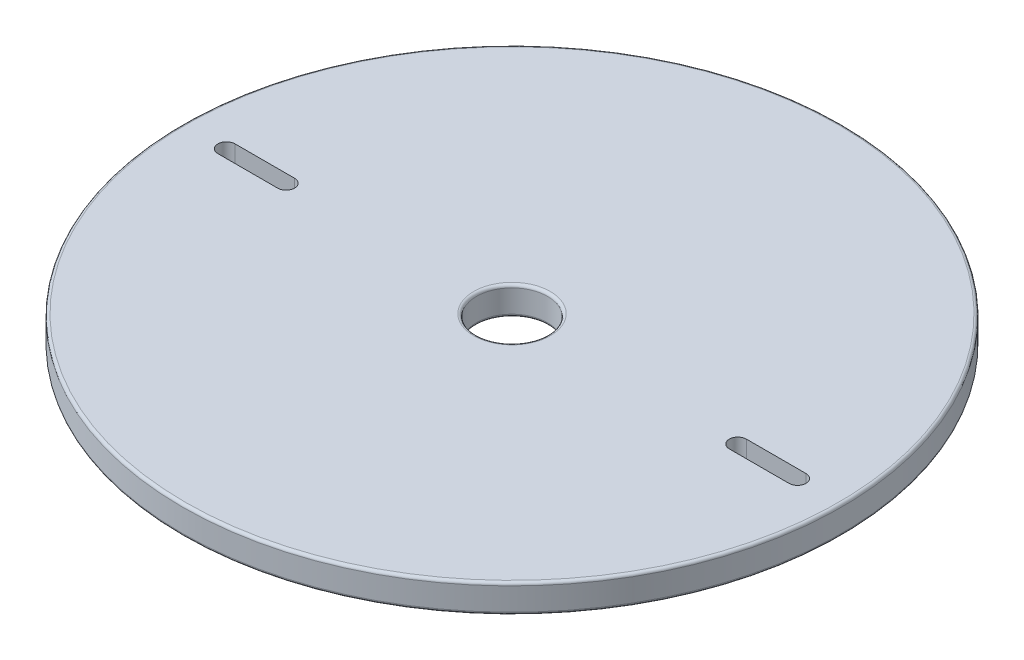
ISO-10303-21;
HEADER;
FILE_DESCRIPTION(('STEP AP214'),'2;1');
FILE_NAME('part.step','',(''),(''),'','','');
FILE_SCHEMA(('AUTOMOTIVE_DESIGN { 1 0 10303 214 1 1 1 1 }'));
ENDSEC;
DATA;
#1=APPLICATION_CONTEXT('core data for automotive mechanical design processes');
#2=APPLICATION_PROTOCOL_DEFINITION('international standard','automotive_design',2000,#1);
#3=PRODUCT_CONTEXT('',#1,'mechanical');
#4=PRODUCT('Part','Part','',(#3));
#5=PRODUCT_RELATED_PRODUCT_CATEGORY('part','',(#4));
#6=PRODUCT_DEFINITION_FORMATION('','',#4);
#7=PRODUCT_DEFINITION_CONTEXT('part definition',#1,'design');
#8=PRODUCT_DEFINITION('design','',#6,#7);
#9=PRODUCT_DEFINITION_SHAPE('','',#8);
#10=(LENGTH_UNIT() NAMED_UNIT(*) SI_UNIT(.MILLI.,.METRE.));
#11=(NAMED_UNIT(*) PLANE_ANGLE_UNIT() SI_UNIT($,.RADIAN.));
#12=(NAMED_UNIT(*) SI_UNIT($,.STERADIAN.) SOLID_ANGLE_UNIT());
#13=UNCERTAINTY_MEASURE_WITH_UNIT(LENGTH_MEASURE(1.E-05),#10,'distance_accuracy_value','');
#14=(GEOMETRIC_REPRESENTATION_CONTEXT(3) GLOBAL_UNCERTAINTY_ASSIGNED_CONTEXT((#13)) GLOBAL_UNIT_ASSIGNED_CONTEXT((#10,
#11,#12)) REPRESENTATION_CONTEXT('',''));
#15=CARTESIAN_POINT('',(0.,0.,0.));
#16=DIRECTION('',(0.,0.,1.));
#17=DIRECTION('',(1.,0.,0.));
#18=AXIS2_PLACEMENT_3D('',#15,#16,#17);
#19=CARTESIAN_POINT('',(0.,0.5,0.));
#20=DIRECTION('',(0.,1.,0.));
#21=DIRECTION('',(0.,0.,1.));
#22=AXIS2_PLACEMENT_3D('',#19,#20,#21);
#23=PLANE('',#22);
#24=CARTESIAN_POINT('',(0.,0.5,0.));
#25=DIRECTION('',(0.,1.,0.));
#26=DIRECTION('',(0.,0.,1.));
#27=AXIS2_PLACEMENT_3D('',#24,#25,#26);
#28=CIRCLE('',#27,11.5);
#29=CARTESIAN_POINT('',(0.,0.5,11.5));
#30=VERTEX_POINT('',#29);
#31=EDGE_CURVE('E177',#30,#30,#28,.T.);
#32=ORIENTED_EDGE('',*,*,#31,.T.);
#33=EDGE_LOOP('',(#32));
#34=FACE_BOUND('',#33,.T.);
#35=CARTESIAN_POINT('',(0.,0.5,0.));
#36=DIRECTION('',(0.,1.,0.));
#37=DIRECTION('',(0.,0.,1.));
#38=AXIS2_PLACEMENT_3D('',#35,#36,#37);
#39=CIRCLE('',#38,1.35);
#40=CARTESIAN_POINT('',(0.,0.5,1.35));
#41=VERTEX_POINT('',#40);
#42=EDGE_CURVE('E174',#41,#41,#39,.F.);
#43=ORIENTED_EDGE('',*,*,#42,.T.);
#44=EDGE_LOOP('',(#43));
#45=FACE_BOUND('',#44,.T.);
#46=CARTESIAN_POINT('',(-10.05,0.5,0.));
#47=DIRECTION('',(0.,1.,0.));
#48=DIRECTION('',(0.,0.,1.));
#49=AXIS2_PLACEMENT_3D('',#46,#47,#48);
#50=CIRCLE('',#49,0.3);
#51=CARTESIAN_POINT('',(-10.05,0.5,-0.3));
#52=VERTEX_POINT('',#51);
#53=CARTESIAN_POINT('',(-10.05,0.5,0.3));
#54=VERTEX_POINT('',#53);
#55=EDGE_CURVE('E139',#52,#54,#50,.T.);
#56=ORIENTED_EDGE('',*,*,#55,.F.);
#57=DIRECTION('',(-1.,0.,0.));
#58=VECTOR('',#57,1.);
#59=CARTESIAN_POINT('',(-10.05,0.5,-0.3));
#60=LINE('',#59,#58);
#61=CARTESIAN_POINT('',(-7.95,0.5,-0.3));
#62=VERTEX_POINT('',#61);
#63=EDGE_CURVE('E147',#62,#52,#60,.T.);
#64=ORIENTED_EDGE('',*,*,#63,.F.);
#65=CARTESIAN_POINT('',(-7.95,0.5,0.));
#66=DIRECTION('',(0.,1.,0.));
#67=DIRECTION('',(0.,0.,1.));
#68=AXIS2_PLACEMENT_3D('',#65,#66,#67);
#69=CIRCLE('',#68,0.3);
#70=CARTESIAN_POINT('',(-7.95,0.5,0.3));
#71=VERTEX_POINT('',#70);
#72=EDGE_CURVE('E144',#71,#62,#69,.T.);
#73=ORIENTED_EDGE('',*,*,#72,.F.);
#74=DIRECTION('',(1.,0.,0.));
#75=VECTOR('',#74,1.);
#76=CARTESIAN_POINT('',(-10.05,0.5,0.3));
#77=LINE('',#76,#75);
#78=EDGE_CURVE('E141',#54,#71,#77,.T.);
#79=ORIENTED_EDGE('',*,*,#78,.F.);
#80=EDGE_LOOP('',(#56,#64,#73,#79));
#81=FACE_BOUND('',#80,.T.);
#82=DIRECTION('',(1.,0.,0.));
#83=VECTOR('',#82,1.);
#84=CARTESIAN_POINT('',(10.05,0.5,-0.3));
#85=LINE('',#84,#83);
#86=CARTESIAN_POINT('',(7.95,0.5,-0.3));
#87=VERTEX_POINT('',#86);
#88=CARTESIAN_POINT('',(10.05,0.5,-0.3));
#89=VERTEX_POINT('',#88);
#90=EDGE_CURVE('E116',#87,#89,#85,.T.);
#91=ORIENTED_EDGE('',*,*,#90,.T.);
#92=CARTESIAN_POINT('',(10.05,0.5,0.));
#93=DIRECTION('',(0.,-1.,0.));
#94=DIRECTION('',(0.,0.,1.));
#95=AXIS2_PLACEMENT_3D('',#92,#93,#94);
#96=CIRCLE('',#95,0.3);
#97=CARTESIAN_POINT('',(10.05,0.5,0.3));
#98=VERTEX_POINT('',#97);
#99=EDGE_CURVE('E48',#89,#98,#96,.T.);
#100=ORIENTED_EDGE('',*,*,#99,.T.);
#101=DIRECTION('',(-1.,0.,0.));
#102=VECTOR('',#101,1.);
#103=CARTESIAN_POINT('',(10.05,0.5,0.3));
#104=LINE('',#103,#102);
#105=CARTESIAN_POINT('',(7.95,0.5,0.3));
#106=VERTEX_POINT('',#105);
#107=EDGE_CURVE('E110',#98,#106,#104,.T.);
#108=ORIENTED_EDGE('',*,*,#107,.T.);
#109=CARTESIAN_POINT('',(7.95,0.5,0.));
#110=DIRECTION('',(0.,-1.,0.));
#111=DIRECTION('',(0.,0.,1.));
#112=AXIS2_PLACEMENT_3D('',#109,#110,#111);
#113=CIRCLE('',#112,0.3);
#114=EDGE_CURVE('E123',#106,#87,#113,.T.);
#115=ORIENTED_EDGE('',*,*,#114,.T.);
#116=EDGE_LOOP('',(#91,#100,#108,#115));
#117=FACE_BOUND('',#116,.T.);
#118=ADVANCED_FACE('F33',(#34,#45,#81,#117),#23,.T.);
#119=CARTESIAN_POINT('',(0.,-0.5,0.));
#120=DIRECTION('',(0.,1.,0.));
#121=DIRECTION('',(0.,0.,1.));
#122=AXIS2_PLACEMENT_3D('',#119,#120,#121);
#123=PLANE('',#122);
#124=CARTESIAN_POINT('',(0.,-0.5,0.));
#125=DIRECTION('',(0.,1.,0.));
#126=DIRECTION('',(0.,0.,1.));
#127=AXIS2_PLACEMENT_3D('',#124,#125,#126);
#128=CIRCLE('',#127,11.5);
#129=CARTESIAN_POINT('',(0.,-0.5,11.5));
#130=VERTEX_POINT('',#129);
#131=EDGE_CURVE('E171',#130,#130,#128,.F.);
#132=ORIENTED_EDGE('',*,*,#131,.T.);
#133=EDGE_LOOP('',(#132));
#134=FACE_BOUND('',#133,.T.);
#135=CARTESIAN_POINT('',(0.,-0.5,0.));
#136=DIRECTION('',(0.,1.,0.));
#137=DIRECTION('',(0.,0.,1.));
#138=AXIS2_PLACEMENT_3D('',#135,#136,#137);
#139=CIRCLE('',#138,1.35);
#140=CARTESIAN_POINT('',(0.,-0.5,1.35));
#141=VERTEX_POINT('',#140);
#142=EDGE_CURVE('E168',#141,#141,#139,.T.);
#143=ORIENTED_EDGE('',*,*,#142,.T.);
#144=EDGE_LOOP('',(#143));
#145=FACE_BOUND('',#144,.T.);
#146=DIRECTION('',(1.,0.,0.));
#147=VECTOR('',#146,1.);
#148=CARTESIAN_POINT('',(-10.05,-0.5,-0.3));
#149=LINE('',#148,#147);
#150=CARTESIAN_POINT('',(-10.05,-0.5,-0.3));
#151=VERTEX_POINT('',#150);
#152=CARTESIAN_POINT('',(-7.95,-0.5,-0.3));
#153=VERTEX_POINT('',#152);
#154=EDGE_CURVE('E133',#151,#153,#149,.T.);
#155=ORIENTED_EDGE('',*,*,#154,.F.);
#156=CARTESIAN_POINT('',(-10.05,-0.5,0.));
#157=DIRECTION('',(0.,1.,0.));
#158=DIRECTION('',(0.,0.,1.));
#159=AXIS2_PLACEMENT_3D('',#156,#157,#158);
#160=CIRCLE('',#159,0.3);
#161=CARTESIAN_POINT('',(-10.05,-0.5,0.3));
#162=VERTEX_POINT('',#161);
#163=EDGE_CURVE('E136',#162,#151,#160,.F.);
#164=ORIENTED_EDGE('',*,*,#163,.F.);
#165=DIRECTION('',(-1.,0.,0.));
#166=VECTOR('',#165,1.);
#167=CARTESIAN_POINT('',(-10.05,-0.5,0.3));
#168=LINE('',#167,#166);
#169=CARTESIAN_POINT('',(-7.95,-0.5,0.3));
#170=VERTEX_POINT('',#169);
#171=EDGE_CURVE('E153',#170,#162,#168,.T.);
#172=ORIENTED_EDGE('',*,*,#171,.F.);
#173=CARTESIAN_POINT('',(-7.95,-0.5,0.));
#174=DIRECTION('',(0.,1.,0.));
#175=DIRECTION('',(0.,0.,1.));
#176=AXIS2_PLACEMENT_3D('',#173,#174,#175);
#177=CIRCLE('',#176,0.3);
#178=EDGE_CURVE('E104',#153,#170,#177,.F.);
#179=ORIENTED_EDGE('',*,*,#178,.F.);
#180=EDGE_LOOP('',(#155,#164,#172,#179));
#181=FACE_BOUND('',#180,.T.);
#182=CARTESIAN_POINT('',(10.05,-0.5,0.));
#183=DIRECTION('',(0.,1.,0.));
#184=DIRECTION('',(0.,0.,1.));
#185=AXIS2_PLACEMENT_3D('',#182,#183,#184);
#186=CIRCLE('',#185,0.3);
#187=CARTESIAN_POINT('',(10.05,-0.5,0.3));
#188=VERTEX_POINT('',#187);
#189=CARTESIAN_POINT('',(10.05,-0.5,-0.3));
#190=VERTEX_POINT('',#189);
#191=EDGE_CURVE('E108',#188,#190,#186,.T.);
#192=ORIENTED_EDGE('',*,*,#191,.T.);
#193=DIRECTION('',(-1.,0.,0.));
#194=VECTOR('',#193,1.);
#195=CARTESIAN_POINT('',(10.05,-0.5,-0.3));
#196=LINE('',#195,#194);
#197=CARTESIAN_POINT('',(7.95,-0.5,-0.3));
#198=VERTEX_POINT('',#197);
#199=EDGE_CURVE('E97',#190,#198,#196,.T.);
#200=ORIENTED_EDGE('',*,*,#199,.T.);
#201=CARTESIAN_POINT('',(7.95,-0.5,0.));
#202=DIRECTION('',(0.,1.,0.));
#203=DIRECTION('',(0.,0.,1.));
#204=AXIS2_PLACEMENT_3D('',#201,#202,#203);
#205=CIRCLE('',#204,0.3);
#206=CARTESIAN_POINT('',(7.95,-0.5,0.3));
#207=VERTEX_POINT('',#206);
#208=EDGE_CURVE('E118',#198,#207,#205,.T.);
#209=ORIENTED_EDGE('',*,*,#208,.T.);
#210=DIRECTION('',(1.,0.,0.));
#211=VECTOR('',#210,1.);
#212=CARTESIAN_POINT('',(10.05,-0.5,0.3));
#213=LINE('',#212,#211);
#214=EDGE_CURVE('E114',#207,#188,#213,.T.);
#215=ORIENTED_EDGE('',*,*,#214,.T.);
#216=EDGE_LOOP('',(#192,#200,#209,#215));
#217=FACE_BOUND('',#216,.T.);
#218=ADVANCED_FACE('F113',(#134,#145,#181,#217),#123,.F.);
#219=CARTESIAN_POINT('',(0.,0.5,0.));
#220=DIRECTION('',(0.,-1.,0.));
#221=DIRECTION('',(0.,0.,-1.));
#222=AXIS2_PLACEMENT_3D('',#219,#220,#221);
#223=CYLINDRICAL_SURFACE('',#222,11.6);
#224=CARTESIAN_POINT('',(0.,-0.4,0.));
#225=DIRECTION('',(0.,1.,0.));
#226=DIRECTION('',(0.,0.,1.));
#227=AXIS2_PLACEMENT_3D('',#224,#225,#226);
#228=CIRCLE('',#227,11.6);
#229=CARTESIAN_POINT('',(0.,-0.4,11.6));
#230=VERTEX_POINT('',#229);
#231=EDGE_CURVE('E165',#230,#230,#228,.T.);
#232=ORIENTED_EDGE('',*,*,#231,.T.);
#233=EDGE_LOOP('',(#232));
#234=FACE_BOUND('',#233,.T.);
#235=CARTESIAN_POINT('',(0.,0.4,0.));
#236=DIRECTION('',(0.,1.,0.));
#237=DIRECTION('',(0.,0.,1.));
#238=AXIS2_PLACEMENT_3D('',#235,#236,#237);
#239=CIRCLE('',#238,11.6);
#240=CARTESIAN_POINT('',(0.,0.4,11.6));
#241=VERTEX_POINT('',#240);
#242=EDGE_CURVE('E162',#241,#241,#239,.F.);
#243=ORIENTED_EDGE('',*,*,#242,.T.);
#244=EDGE_LOOP('',(#243));
#245=FACE_BOUND('',#244,.T.);
#246=ADVANCED_FACE('F200',(#234,#245),#223,.T.);
#247=CARTESIAN_POINT('',(-10.05,-0.501,0.));
#248=DIRECTION('',(0.,1.,0.));
#249=DIRECTION('',(0.,0.,1.));
#250=AXIS2_PLACEMENT_3D('',#247,#248,#249);
#251=CYLINDRICAL_SURFACE('',#250,0.3);
#252=ORIENTED_EDGE('',*,*,#163,.T.);
#253=DIRECTION('',(0.,1.,0.));
#254=VECTOR('',#253,1.);
#255=CARTESIAN_POINT('',(-10.05,-0.501,-0.3));
#256=LINE('',#255,#254);
#257=EDGE_CURVE('E151',#151,#52,#256,.T.);
#258=ORIENTED_EDGE('',*,*,#257,.T.);
#259=ORIENTED_EDGE('',*,*,#55,.T.);
#260=DIRECTION('',(0.,1.,0.));
#261=VECTOR('',#260,1.);
#262=CARTESIAN_POINT('',(-10.05,-0.501,0.3));
#263=LINE('',#262,#261);
#264=EDGE_CURVE('E150',#162,#54,#263,.T.);
#265=ORIENTED_EDGE('',*,*,#264,.F.);
#266=EDGE_LOOP('',(#252,#258,#259,#265));
#267=FACE_BOUND('',#266,.T.);
#268=ADVANCED_FACE('F205',(#267),#251,.F.);
#269=CARTESIAN_POINT('',(-10.05,-0.501,-0.3));
#270=DIRECTION('',(0.,0.,-1.));
#271=DIRECTION('',(-1.,0.,0.));
#272=AXIS2_PLACEMENT_3D('',#269,#270,#271);
#273=PLANE('',#272);
#274=ORIENTED_EDGE('',*,*,#154,.T.);
#275=DIRECTION('',(0.,1.,0.));
#276=VECTOR('',#275,1.);
#277=CARTESIAN_POINT('',(-7.95,-0.501,-0.3));
#278=LINE('',#277,#276);
#279=EDGE_CURVE('E154',#153,#62,#278,.T.);
#280=ORIENTED_EDGE('',*,*,#279,.T.);
#281=ORIENTED_EDGE('',*,*,#63,.T.);
#282=ORIENTED_EDGE('',*,*,#257,.F.);
#283=EDGE_LOOP('',(#274,#280,#281,#282));
#284=FACE_BOUND('',#283,.T.);
#285=ADVANCED_FACE('F307',(#284),#273,.F.);
#286=CARTESIAN_POINT('',(-7.95,-0.501,0.));
#287=DIRECTION('',(0.,1.,0.));
#288=DIRECTION('',(0.,0.,1.));
#289=AXIS2_PLACEMENT_3D('',#286,#287,#288);
#290=CYLINDRICAL_SURFACE('',#289,0.3);
#291=ORIENTED_EDGE('',*,*,#178,.T.);
#292=DIRECTION('',(0.,1.,0.));
#293=VECTOR('',#292,1.);
#294=CARTESIAN_POINT('',(-7.95,-0.501,0.3));
#295=LINE('',#294,#293);
#296=EDGE_CURVE('E156',#170,#71,#295,.T.);
#297=ORIENTED_EDGE('',*,*,#296,.T.);
#298=ORIENTED_EDGE('',*,*,#72,.T.);
#299=ORIENTED_EDGE('',*,*,#279,.F.);
#300=EDGE_LOOP('',(#291,#297,#298,#299));
#301=FACE_BOUND('',#300,.T.);
#302=ADVANCED_FACE('F299',(#301),#290,.F.);
#303=CARTESIAN_POINT('',(-10.05,-0.501,0.3));
#304=DIRECTION('',(0.,0.,1.));
#305=DIRECTION('',(1.,0.,0.));
#306=AXIS2_PLACEMENT_3D('',#303,#304,#305);
#307=PLANE('',#306);
#308=ORIENTED_EDGE('',*,*,#171,.T.);
#309=ORIENTED_EDGE('',*,*,#264,.T.);
#310=ORIENTED_EDGE('',*,*,#78,.T.);
#311=ORIENTED_EDGE('',*,*,#296,.F.);
#312=EDGE_LOOP('',(#308,#309,#310,#311));
#313=FACE_BOUND('',#312,.T.);
#314=ADVANCED_FACE('F281',(#313),#307,.F.);
#315=CARTESIAN_POINT('',(10.05,-0.501,0.));
#316=DIRECTION('',(0.,1.,0.));
#317=DIRECTION('',(0.,0.,1.));
#318=AXIS2_PLACEMENT_3D('',#315,#316,#317);
#319=CYLINDRICAL_SURFACE('',#318,0.3);
#320=DIRECTION('',(0.,1.,0.));
#321=VECTOR('',#320,1.);
#322=CARTESIAN_POINT('',(10.05,-0.501,0.3));
#323=LINE('',#322,#321);
#324=EDGE_CURVE('E105',#188,#98,#323,.T.);
#325=ORIENTED_EDGE('',*,*,#324,.T.);
#326=ORIENTED_EDGE('',*,*,#99,.F.);
#327=DIRECTION('',(0.,1.,0.));
#328=VECTOR('',#327,1.);
#329=CARTESIAN_POINT('',(10.05,-0.501,-0.3));
#330=LINE('',#329,#328);
#331=EDGE_CURVE('E99',#190,#89,#330,.T.);
#332=ORIENTED_EDGE('',*,*,#331,.F.);
#333=ORIENTED_EDGE('',*,*,#191,.F.);
#334=EDGE_LOOP('',(#325,#326,#332,#333));
#335=FACE_BOUND('',#334,.T.);
#336=ADVANCED_FACE('F107',(#335),#319,.F.);
#337=CARTESIAN_POINT('',(10.05,-0.501,0.3));
#338=DIRECTION('',(0.,0.,-1.));
#339=DIRECTION('',(-1.,0.,0.));
#340=AXIS2_PLACEMENT_3D('',#337,#338,#339);
#341=PLANE('',#340);
#342=DIRECTION('',(0.,1.,0.));
#343=VECTOR('',#342,1.);
#344=CARTESIAN_POINT('',(7.95,-0.501,0.3));
#345=LINE('',#344,#343);
#346=EDGE_CURVE('E129',#207,#106,#345,.T.);
#347=ORIENTED_EDGE('',*,*,#346,.T.);
#348=ORIENTED_EDGE('',*,*,#107,.F.);
#349=ORIENTED_EDGE('',*,*,#324,.F.);
#350=ORIENTED_EDGE('',*,*,#214,.F.);
#351=EDGE_LOOP('',(#347,#348,#349,#350));
#352=FACE_BOUND('',#351,.T.);
#353=ADVANCED_FACE('F264',(#352),#341,.T.);
#354=CARTESIAN_POINT('',(7.95,-0.501,0.));
#355=DIRECTION('',(0.,1.,0.));
#356=DIRECTION('',(0.,0.,1.));
#357=AXIS2_PLACEMENT_3D('',#354,#355,#356);
#358=CYLINDRICAL_SURFACE('',#357,0.3);
#359=DIRECTION('',(0.,1.,0.));
#360=VECTOR('',#359,1.);
#361=CARTESIAN_POINT('',(7.95,-0.501,-0.3));
#362=LINE('',#361,#360);
#363=EDGE_CURVE('E56',#198,#87,#362,.T.);
#364=ORIENTED_EDGE('',*,*,#363,.T.);
#365=ORIENTED_EDGE('',*,*,#114,.F.);
#366=ORIENTED_EDGE('',*,*,#346,.F.);
#367=ORIENTED_EDGE('',*,*,#208,.F.);
#368=EDGE_LOOP('',(#364,#365,#366,#367));
#369=FACE_BOUND('',#368,.T.);
#370=ADVANCED_FACE('F256',(#369),#358,.F.);
#371=CARTESIAN_POINT('',(10.05,-0.501,-0.3));
#372=DIRECTION('',(0.,0.,1.));
#373=DIRECTION('',(1.,0.,0.));
#374=AXIS2_PLACEMENT_3D('',#371,#372,#373);
#375=PLANE('',#374);
#376=ORIENTED_EDGE('',*,*,#331,.T.);
#377=ORIENTED_EDGE('',*,*,#90,.F.);
#378=ORIENTED_EDGE('',*,*,#363,.F.);
#379=ORIENTED_EDGE('',*,*,#199,.F.);
#380=EDGE_LOOP('',(#376,#377,#378,#379));
#381=FACE_BOUND('',#380,.T.);
#382=ADVANCED_FACE('F98',(#381),#375,.T.);
#383=CARTESIAN_POINT('',(0.,-0.501,0.));
#384=DIRECTION('',(0.,1.,0.));
#385=DIRECTION('',(0.,0.,1.));
#386=AXIS2_PLACEMENT_3D('',#383,#384,#385);
#387=CYLINDRICAL_SURFACE('',#386,1.25);
#388=CARTESIAN_POINT('',(0.,-0.4,0.));
#389=DIRECTION('',(0.,1.,0.));
#390=DIRECTION('',(0.,0.,1.));
#391=AXIS2_PLACEMENT_3D('',#388,#389,#390);
#392=CIRCLE('',#391,1.25);
#393=CARTESIAN_POINT('',(0.,-0.4,1.25));
#394=VERTEX_POINT('',#393);
#395=EDGE_CURVE('E11',#394,#394,#392,.F.);
#396=ORIENTED_EDGE('',*,*,#395,.T.);
#397=EDGE_LOOP('',(#396));
#398=FACE_BOUND('',#397,.T.);
#399=CARTESIAN_POINT('',(0.,0.4,0.));
#400=DIRECTION('',(0.,1.,0.));
#401=DIRECTION('',(0.,0.,1.));
#402=AXIS2_PLACEMENT_3D('',#399,#400,#401);
#403=CIRCLE('',#402,1.25);
#404=CARTESIAN_POINT('',(0.,0.4,1.25));
#405=VERTEX_POINT('',#404);
#406=EDGE_CURVE('E41',#405,#405,#403,.T.);
#407=ORIENTED_EDGE('',*,*,#406,.T.);
#408=EDGE_LOOP('',(#407));
#409=FACE_BOUND('',#408,.T.);
#410=ADVANCED_FACE('F182',(#398,#409),#387,.F.);
#411=CARTESIAN_POINT('',(0.,-0.4,0.));
#412=DIRECTION('',(0.,1.,0.));
#413=DIRECTION('',(0.,0.,1.));
#414=AXIS2_PLACEMENT_3D('',#411,#412,#413);
#415=TOROIDAL_SURFACE('',#414,11.5,0.1);
#416=ORIENTED_EDGE('',*,*,#131,.F.);
#417=EDGE_LOOP('',(#416));
#418=FACE_BOUND('',#417,.T.);
#419=ORIENTED_EDGE('',*,*,#231,.F.);
#420=EDGE_LOOP('',(#419));
#421=FACE_BOUND('',#420,.T.);
#422=ADVANCED_FACE('F211',(#418,#421),#415,.T.);
#423=CARTESIAN_POINT('',(0.,0.4,0.));
#424=DIRECTION('',(0.,1.,0.));
#425=DIRECTION('',(0.,0.,1.));
#426=AXIS2_PLACEMENT_3D('',#423,#424,#425);
#427=TOROIDAL_SURFACE('',#426,11.5,0.1);
#428=ORIENTED_EDGE('',*,*,#242,.F.);
#429=EDGE_LOOP('',(#428));
#430=FACE_BOUND('',#429,.T.);
#431=ORIENTED_EDGE('',*,*,#31,.F.);
#432=EDGE_LOOP('',(#431));
#433=FACE_BOUND('',#432,.T.);
#434=ADVANCED_FACE('F190',(#430,#433),#427,.T.);
#435=CARTESIAN_POINT('',(0.,-0.4,0.));
#436=DIRECTION('',(0.,1.,0.));
#437=DIRECTION('',(0.,0.,1.));
#438=AXIS2_PLACEMENT_3D('',#435,#436,#437);
#439=TOROIDAL_SURFACE('',#438,1.35,0.1);
#440=ORIENTED_EDGE('',*,*,#142,.F.);
#441=EDGE_LOOP('',(#440));
#442=FACE_BOUND('',#441,.T.);
#443=ORIENTED_EDGE('',*,*,#395,.F.);
#444=EDGE_LOOP('',(#443));
#445=FACE_BOUND('',#444,.T.);
#446=ADVANCED_FACE('F185',(#442,#445),#439,.T.);
#447=CARTESIAN_POINT('',(0.,0.4,0.));
#448=DIRECTION('',(0.,1.,0.));
#449=DIRECTION('',(0.,0.,1.));
#450=AXIS2_PLACEMENT_3D('',#447,#448,#449);
#451=TOROIDAL_SURFACE('',#450,1.35,0.1);
#452=ORIENTED_EDGE('',*,*,#42,.F.);
#453=EDGE_LOOP('',(#452));
#454=FACE_BOUND('',#453,.T.);
#455=ORIENTED_EDGE('',*,*,#406,.F.);
#456=EDGE_LOOP('',(#455));
#457=FACE_BOUND('',#456,.T.);
#458=ADVANCED_FACE('F35',(#454,#457),#451,.T.);
#459=CLOSED_SHELL('',(#118,#218,#246,#268,#285,#302,#314,#336,#353,#370,#382,#410,#422,#434,
#446,#458));
#460=MANIFOLD_SOLID_BREP('B2',#459);
#461=ADVANCED_BREP_SHAPE_REPRESENTATION('',(#18,#460),#14);
#462=SHAPE_DEFINITION_REPRESENTATION(#9,#461);
ENDSEC;
END-ISO-10303-21;
